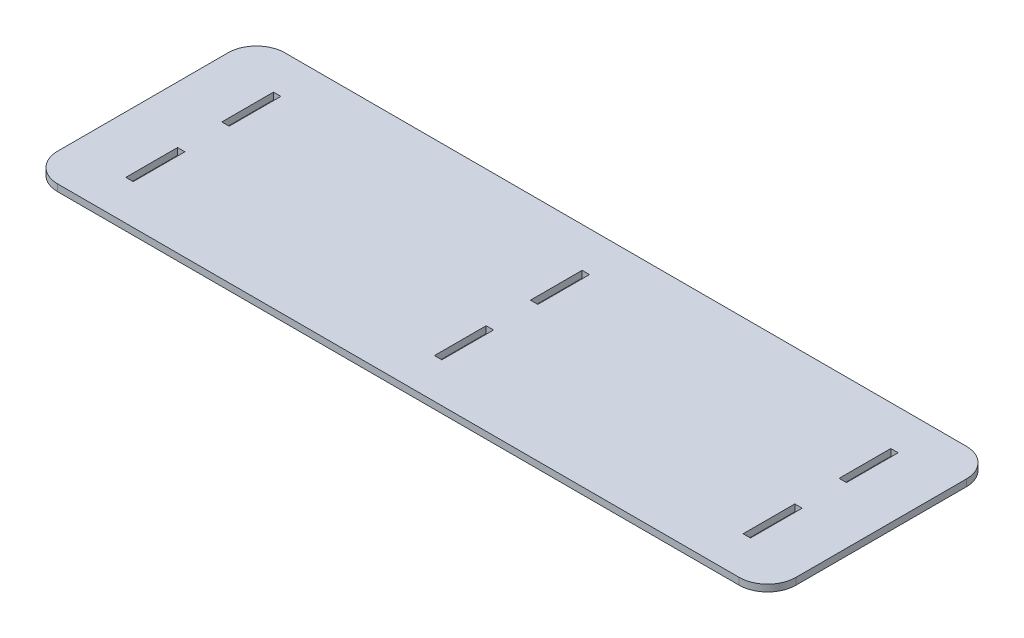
from build123d import *

# Parameters (mm, degrees)
SKETCH1_W           = 1300
SKETCH1_H           = 400
SKETCH1_W_2         = 13
SKETCH1_H_2         = 91
BOSS_EXTRUDE1_DEPTH = 12
FILLET2_R           = 50


with BuildPart() as part:
    # Sketch1 → Boss-Extrude1 (new body)
    with BuildSketch(Plane(origin=(0, 0, 0), x_dir=(1, 0, 0), z_dir=(0, 1, 0))):
        Rectangle(SKETCH1_W, SKETCH1_H)
        with Locations((-543.5, -84.5)):
            Rectangle(SKETCH1_W_2, SKETCH1_H_2, mode=Mode.SUBTRACT)
        with Locations((-543.5, 84.5)):
            Rectangle(SKETCH1_W_2, SKETCH1_H_2, mode=Mode.SUBTRACT)
        with Locations((543.5, -84.5)):
            Rectangle(SKETCH1_W_2, SKETCH1_H_2, mode=Mode.SUBTRACT)
        with Locations((543.5, 84.5)):
            Rectangle(SKETCH1_W_2, SKETCH1_H_2, mode=Mode.SUBTRACT)
        with Locations((0, 84.5)):
            Rectangle(SKETCH1_W_2, SKETCH1_H_2, mode=Mode.SUBTRACT)
        with Locations((0, -84.5)):
            Rectangle(SKETCH1_W_2, SKETCH1_H_2, mode=Mode.SUBTRACT)
    extrude(amount=BOSS_EXTRUDE1_DEPTH)

    # Fillet2
    fillet2_edges = [part.edges().sort_by_distance(p)[0] for p in [
        (650, 6, 200),
        (-650, 6, 200),
        (-650, 6, -200),
        (650, 6, -200),
    ]]
    fillet(fillet2_edges, radius=FILLET2_R)


solid = part.part
